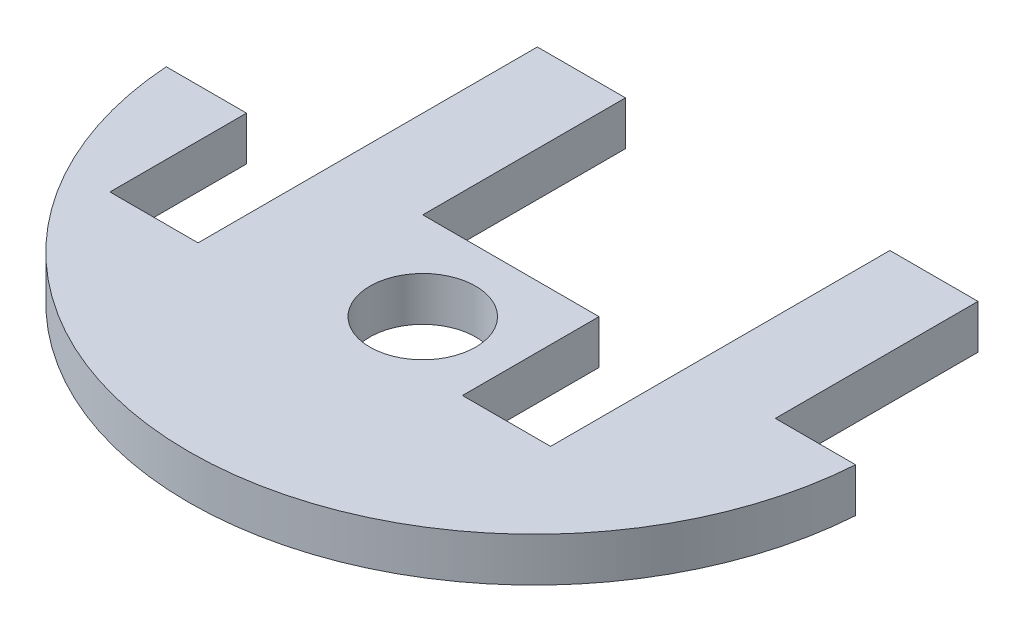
from build123d import *

# Parameters (mm, degrees)
SKETCH1_R           = 24.892
BOSS_EXTRUDE1_DEPTH = 3.175
CUT_EXTRUDE1_DEPTH  = 36.345494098
SKETCH3_W           = 6.35
SKETCH3_H           = 14.605
BOSS_EXTRUDE2_DEPTH = 3.175
SKETCH5_W           = 6.35
SKETCH5_H           = 9.8425
CUT_EXTRUDE2_DEPTH  = 36.305111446
SKETCH6_R           = 3.81
CUT_EXTRUDE3_DEPTH  = 36.305111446


with BuildPart() as part:
    # Sketch1 → Boss-Extrude1 (new body)
    with BuildSketch(Plane(origin=(0, 0, 0), x_dir=(1, 0, 0), z_dir=(0, 1, 0))):
        with Locations(Location((0, 0, 0), (0, 0, 270))):
            Circle(SKETCH1_R)
    extrude(amount=BOSS_EXTRUDE1_DEPTH)

    # Sketch2 → Cut-Extrude1 (cut, through all)
    with BuildSketch(Plane(origin=(0, 3.175, 0), x_dir=(1, 0, 0), z_dir=(0, 1, 0))):
        Polygon((-30.904781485, 1.920088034), (-28.120957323, 27.316200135), (-0.967504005, 28.172881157), (21.786404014, 24.809475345), (27.186913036, 1.4859), (27.186913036, -1.6891), (-30.904781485, -1.6891), align=None)
    extrude(amount=-CUT_EXTRUDE1_DEPTH, mode=Mode.SUBTRACT)

    # Sketch3 → Boss-Extrude2 (add)
    with BuildSketch(Plane(origin=(0, 3.175, 0), x_dir=(1, 0, 0), z_dir=(0, 1, 0))):
        with Locations((15.875, 5.6134)):
            Rectangle(SKETCH3_W, SKETCH3_H)
        with Locations((-9.525, 5.6134)):
            Rectangle(SKETCH3_W, SKETCH3_H)
    extrude(amount=-BOSS_EXTRUDE2_DEPTH)

    # Sketch5 → Cut-Extrude2 (cut, through all)
    with BuildSketch(Plane(origin=(0, 3.175, 0), x_dir=(1, 0, 0), z_dir=(0, 1, 0))):
        with Locations((9.525, -6.61035)):
            Rectangle(SKETCH5_W, SKETCH5_H)
        with Locations((-15.875, -6.61035)):
            Rectangle(SKETCH5_W, SKETCH5_H)
    extrude(amount=-CUT_EXTRUDE2_DEPTH, mode=Mode.SUBTRACT)

    # Sketch6 → Cut-Extrude3 (cut, through all)
    with BuildSketch(Plane(origin=(0, 3.175, 0), x_dir=(1, 0, 0), z_dir=(0, 1, 0))):
        with Locations(Location((0, -8.0391, 0), (0, 0, 270))):
            Circle(SKETCH6_R)
    extrude(amount=-CUT_EXTRUDE3_DEPTH, mode=Mode.SUBTRACT)


solid = part.part
